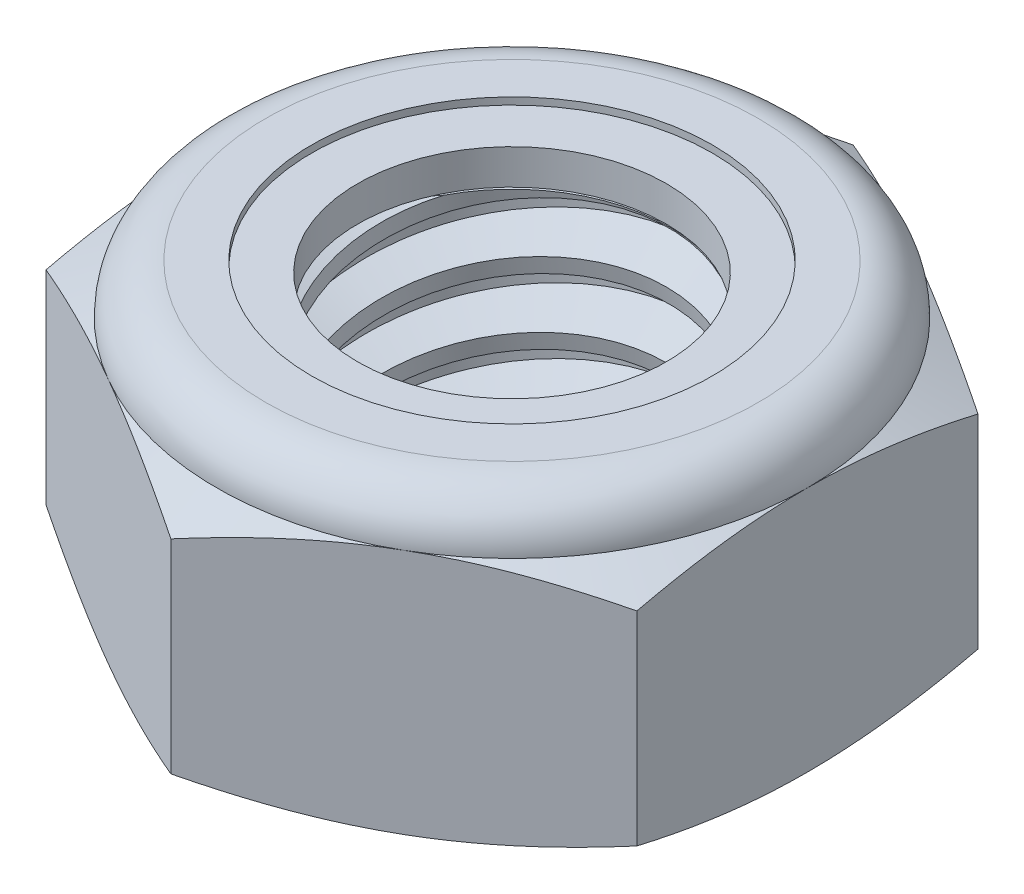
from build123d import *

# Parameters (mm, degrees)
EXTRUDE1_DEPTH      = 6.35
SKETCH2_W           = 3.9624
SKETCH2_H           = 6.35
LPATTERN1_COUNT     = 4
LPATTERN1_PITCH     = 1.411111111
LPATTERN1_COL_COUNT = 2
LPATTERN1_COL_PITCH = 1.411111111


with BuildPart() as part:
    # Sketch1 → Extrude1 (new body)
    with BuildSketch(Plane(origin=(0, 0, 0), x_dir=(1, 0, 0), z_dir=(0, 1, 0))):
        Polygon((0, 7.332348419), (-6.35, 3.666174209), (-6.35, -3.666174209), (0, -7.332348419), (6.35, -3.666174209), (6.35, 3.666174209), align=None)
    extrude(amount=EXTRUDE1_DEPTH)

    # Sketch4 → Cut-Revolve2 (revolve, cut)
    with BuildSketch(Plane(origin=(0, 0, 0), x_dir=(0, 0, -1), z_dir=(1, 0, 0)), mode=Mode.PRIVATE) as cut_revolve2_sk:
        Polygon((0, 6.35), (3.9624, 6.35), (3.318668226, 6.049822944), (3.318668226, 0.300177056), (3.9624, 0), (0, 0), align=None)
    revolve(cut_revolve2_sk.sketch.rotate(Axis((0, 6.35, 0), (0, 1, 0)), 33.002260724), axis=Axis((0, 6.35, 0), (0, 1, 0)), mode=Mode.SUBTRACT)


with BuildPart() as body_2:
    # Sketch2 → Revolve1 (revolve)
    with BuildSketch(Plane(origin=(0, 0, 0), x_dir=(0, 0, -1), z_dir=(1, 0, 0))):
        with Locations((1.9812, 3.175)):
            Rectangle(SKETCH2_W, SKETCH2_H)
    revolve(axis=Axis((0, -3.9624, 0), (0, 1, 0)))

    # Sketch3 → Cut-Revolve1 (revolve, cut)
    with BuildSketch(Plane(origin=(0, 0, 0), x_dir=(0, 0, -1), z_dir=(1, 0, 0)), mode=Mode.PRIVATE) as cut_revolve1_sk:
        Polygon((3.993321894, 6.176342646), (4.209775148, 4.960741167), (3.380512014, 5.260988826), (3.318668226, 5.608303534), align=None)
    cut_revolve1 = revolve(cut_revolve1_sk.sketch.rotate(Axis((0, 6.35, 0.26919352), (0, -0.9845141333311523, -0.17530522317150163)), 180), axis=Axis((0, 6.35, 0.26919352), (0, -0.9845141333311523, -0.17530522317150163)), mode=Mode.SUBTRACT)

    # LPattern1: Cut-Revolve1 ×4
    with Locations(*[(0, -i * LPATTERN1_PITCH, 0) for i in range(1, LPATTERN1_COUNT)]):
        add(cut_revolve1, mode=Mode.SUBTRACT)

    # LPattern1 col: Cut-Revolve1 ×2
    with Locations(*[(0, i * LPATTERN1_COL_PITCH, 0) for i in range(1, LPATTERN1_COL_COUNT)]):
        add(cut_revolve1, mode=Mode.SUBTRACT)


with BuildPart() as part_1:
    add(part.part)

    # Combine1: cut body 2
    add(body_2.part, mode=Mode.SUBTRACT)

    # Sketch5 → Cut-Revolve3 (revolve, cut)
    with BuildSketch(Plane(origin=(0, 0, 0), x_dir=(0, 0, -1), z_dir=(1, 0, 0)), mode=Mode.PRIVATE) as cut_revolve3_sk:
        with BuildLine():
            Line((0, 0), (6.35, 0))
            Line((6.35, 0), (7.332348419, 0.458076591))
            Line((7.332348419, 0.458076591), (7.332348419, 4.833590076))
            Line((7.332348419, 4.833590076), (6.35, 5.291666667))
            ThreePointArc((6.35, 5.291666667), (6.040021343, 6.040021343), (5.291666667, 6.35))
            Line((5.291666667, 6.35), (5.291666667, 7.62))
            Line((5.291666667, 7.62), (8.602348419, 7.62))
            Line((8.602348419, 7.62), (8.602348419, -1.27))
            Line((8.602348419, -1.27), (0, -1.27))
            Line((0, -1.27), (0, 0))
        make_face()
    revolve(cut_revolve3_sk.sketch.rotate(Axis((0, 0, 0), (0, 1, 0)), 54.613905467), axis=Axis((0, 0, 0), (0, 1, 0)), mode=Mode.SUBTRACT)

    # Sketch6 → Cut-Revolve4 (revolve, cut)
    with BuildSketch(Plane(origin=(0, 0, 0), x_dir=(0, 0, -1), z_dir=(1, 0, 0)), mode=Mode.PRIVATE) as cut_revolve4_sk:
        with BuildLine():
            Line((0, 5.291666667), (6.1976, 5.291666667))
            ThreePointArc((6.1976, 5.291666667), (5.93225827, 5.93225827), (5.291666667, 6.1976))
            Line((5.291666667, 6.1976), (4.305167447, 6.1976))
            Line((4.305167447, 6.1976), (4.305167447, 7.62))
            Line((4.305167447, 7.62), (0, 7.62))
            Line((0, 7.62), (0, 5.291666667))
        make_face()
    revolve(cut_revolve4_sk.sketch.rotate(Axis((0, 7.62, 0), (0, 1, 0)), 54.613905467), axis=Axis((0, 7.62, 0), (0, 1, 0)), mode=Mode.SUBTRACT)


with BuildPart() as body_2_2:
    # Sketch7 → Revolve2 (revolve)
    with BuildSketch(Plane(origin=(0, 0, 0), x_dir=(0, 0, -1), z_dir=(1, 0, 0))):
        with BuildLine():
            Line((3.318668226, 5.367866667), (6.117893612, 5.367866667))
            ThreePointArc((6.117893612, 5.367866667), (5.850787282, 5.904725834), (5.291666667, 6.1214))
            Line((5.291666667, 6.1214), (3.318668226, 6.1214))
            Line((3.318668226, 6.1214), (3.318668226, 5.367866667))
        make_face()
    revolve(axis=Axis((0, 5.367866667, 0), (0, 1, 0)))


solid = Compound([part_1.part, body_2_2.part])
